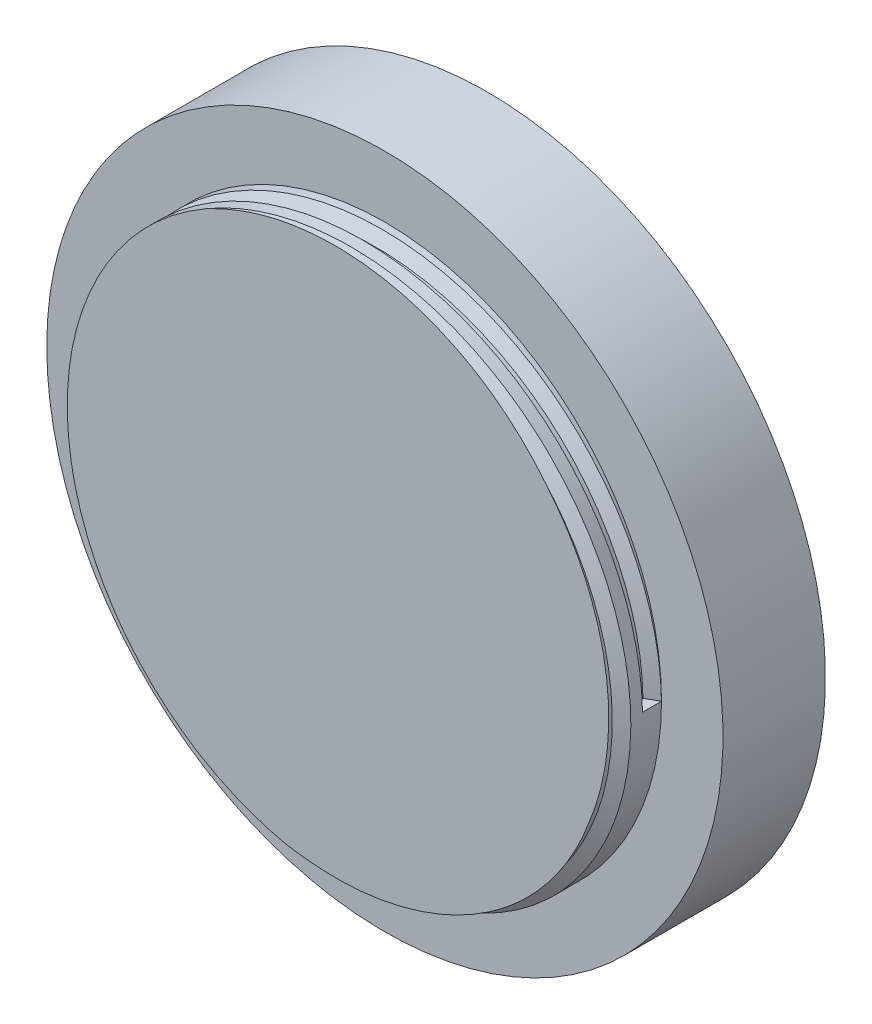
ISO-10303-21;
HEADER;
FILE_DESCRIPTION(('STEP AP214'),'2;1');
FILE_NAME('part.step','',(''),(''),'','','');
FILE_SCHEMA(('AUTOMOTIVE_DESIGN { 1 0 10303 214 1 1 1 1 }'));
ENDSEC;
DATA;
#1=APPLICATION_CONTEXT('core data for automotive mechanical design processes');
#2=APPLICATION_PROTOCOL_DEFINITION('international standard','automotive_design',2000,#1);
#3=PRODUCT_CONTEXT('',#1,'mechanical');
#4=PRODUCT('Part','Part','',(#3));
#5=PRODUCT_RELATED_PRODUCT_CATEGORY('part','',(#4));
#6=PRODUCT_DEFINITION_FORMATION('','',#4);
#7=PRODUCT_DEFINITION_CONTEXT('part definition',#1,'design');
#8=PRODUCT_DEFINITION('design','',#6,#7);
#9=PRODUCT_DEFINITION_SHAPE('','',#8);
#10=(LENGTH_UNIT() NAMED_UNIT(*) SI_UNIT(.MILLI.,.METRE.));
#11=(NAMED_UNIT(*) PLANE_ANGLE_UNIT() SI_UNIT($,.RADIAN.));
#12=(NAMED_UNIT(*) SI_UNIT($,.STERADIAN.) SOLID_ANGLE_UNIT());
#13=UNCERTAINTY_MEASURE_WITH_UNIT(LENGTH_MEASURE(1.E-05),#10,'distance_accuracy_value','');
#14=(GEOMETRIC_REPRESENTATION_CONTEXT(3) GLOBAL_UNCERTAINTY_ASSIGNED_CONTEXT((#13)) GLOBAL_UNIT_ASSIGNED_CONTEXT((#10,
#11,#12)) REPRESENTATION_CONTEXT('',''));
#15=CARTESIAN_POINT('',(0.,0.,0.));
#16=DIRECTION('',(0.,0.,1.));
#17=DIRECTION('',(1.,0.,0.));
#18=AXIS2_PLACEMENT_3D('',#15,#16,#17);
#19=CARTESIAN_POINT('',(0.,0.,2.));
#20=DIRECTION('',(0.,0.,-1.));
#21=DIRECTION('',(-1.,0.,0.));
#22=AXIS2_PLACEMENT_3D('',#19,#20,#21);
#23=CYLINDRICAL_SURFACE('',#22,13.5);
#24=CARTESIAN_POINT('',(13.5,0.,0.));
#25=CARTESIAN_POINT('',(13.5,5.59188309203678,0.09375));
#26=CARTESIAN_POINT('',(9.54594154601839,9.54594154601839,0.1875));
#27=CARTESIAN_POINT('',(5.59188309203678,13.5,0.28125));
#28=CARTESIAN_POINT('',(0.,13.5,0.375));
#29=CARTESIAN_POINT('',(-5.59188309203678,13.5,0.46875));
#30=CARTESIAN_POINT('',(-9.54594154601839,9.54594154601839,0.5625));
#31=CARTESIAN_POINT('',(-13.5,5.59188309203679,0.65625));
#32=CARTESIAN_POINT('',(-13.5,0.,0.75));
#33=CARTESIAN_POINT('',(-13.5,-5.59188309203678,0.84375));
#34=CARTESIAN_POINT('',(-9.54594154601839,-9.54594154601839,0.9375));
#35=CARTESIAN_POINT('',(-5.59188309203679,-13.5,1.03125));
#36=CARTESIAN_POINT('',(0.,-13.5,1.125));
#37=CARTESIAN_POINT('',(5.59188309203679,-13.5,1.21875));
#38=CARTESIAN_POINT('',(9.54594154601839,-9.54594154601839,1.3125));
#39=CARTESIAN_POINT('',(13.5,-5.59188309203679,1.40625));
#40=CARTESIAN_POINT('',(13.5,0.,1.5));
#41=CARTESIAN_POINT('',(13.5,5.59188309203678,1.59375));
#42=CARTESIAN_POINT('',(9.54594154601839,9.54594154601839,1.6875));
#43=CARTESIAN_POINT('',(5.59188309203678,13.5,1.78125));
#44=CARTESIAN_POINT('',(0.,13.5,1.875));
#45=CARTESIAN_POINT('',(-5.59188309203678,13.5,1.96875));
#46=CARTESIAN_POINT('',(-9.54594154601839,9.54594154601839,2.0625));
#47=CARTESIAN_POINT('',(-13.5,5.59188309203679,2.15625));
#48=CARTESIAN_POINT('',(-13.5,0.,2.25));
#49=(BOUNDED_CURVE() B_SPLINE_CURVE(2,(#24,#25,#26,#27,#28,#29,#30,#31,#32,#33,#34,#35,#36,#37,
#38,#39,#40,#41,#42,#43,#44,#45,#46,#47,#48),.UNSPECIFIED.,.F.,
.F.) B_SPLINE_CURVE_WITH_KNOTS((3,2,2,2,2,2,2,2,2,2,2,2,3),(0.,0.0625,0.125,0.1875,0.25,0.3125,
0.375,0.4375,0.5,0.5625,0.625,0.6875,0.75),
.UNSPECIFIED.) CURVE() GEOMETRIC_REPRESENTATION_ITEM() RATIONAL_B_SPLINE_CURVE((1.,
0.923879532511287,1.,0.923879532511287,1.,0.923879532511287,1.,0.923879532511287,1.,
0.923879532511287,1.,0.923879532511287,1.,0.923879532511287,1.,0.923879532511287,1.,
0.923879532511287,1.,0.923879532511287,1.,0.923879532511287,1.,0.923879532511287,1.)) REPRESENTATION_ITEM(''));
#50=CARTESIAN_POINT('',(13.5,0.,0.));
#51=VERTEX_POINT('',#50);
#52=CARTESIAN_POINT('',(-6.71672440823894,11.7105614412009,2.));
#53=VERTEX_POINT('',#52);
#54=EDGE_CURVE('E95',#51,#53,#49,.T.);
#55=ORIENTED_EDGE('',*,*,#54,.F.);
#56=CARTESIAN_POINT('',(0.,0.,0.));
#57=DIRECTION('',(0.,0.,1.));
#58=DIRECTION('',(1.,0.,0.));
#59=AXIS2_PLACEMENT_3D('',#56,#57,#58);
#60=CIRCLE('',#59,13.5);
#61=EDGE_CURVE('E108',#51,#51,#60,.T.);
#62=ORIENTED_EDGE('',*,*,#61,.T.);
#63=DIRECTION('',(0.,0.,1.));
#64=VECTOR('',#63,1.);
#65=CARTESIAN_POINT('',(13.5,0.,0.46302083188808));
#66=LINE('',#65,#64);
#67=CARTESIAN_POINT('',(13.5,0.,0.926041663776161));
#68=VERTEX_POINT('',#67);
#69=EDGE_CURVE('E101',#51,#68,#66,.T.);
#70=ORIENTED_EDGE('',*,*,#69,.T.);
#71=CARTESIAN_POINT('',(13.5,0.,0.926041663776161));
#72=CARTESIAN_POINT('',(13.5,5.59188309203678,1.01979166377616));
#73=CARTESIAN_POINT('',(9.54594154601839,9.54594154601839,1.11354166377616));
#74=CARTESIAN_POINT('',(5.59188309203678,13.5,1.20729166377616));
#75=CARTESIAN_POINT('',(0.,13.5,1.30104166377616));
#76=CARTESIAN_POINT('',(-5.59188309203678,13.5,1.39479166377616));
#77=CARTESIAN_POINT('',(-9.54594154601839,9.54594154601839,1.48854166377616));
#78=CARTESIAN_POINT('',(-13.5,5.59188309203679,1.58229166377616));
#79=CARTESIAN_POINT('',(-13.5,0.,1.67604166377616));
#80=CARTESIAN_POINT('',(-13.5,-5.59188309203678,1.76979166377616));
#81=CARTESIAN_POINT('',(-9.54594154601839,-9.54594154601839,1.86354166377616));
#82=CARTESIAN_POINT('',(-5.59188309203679,-13.5,1.95729166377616));
#83=CARTESIAN_POINT('',(0.,-13.5,2.05104166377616));
#84=CARTESIAN_POINT('',(5.59188309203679,-13.5,2.14479166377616));
#85=CARTESIAN_POINT('',(9.54594154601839,-9.54594154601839,2.23854166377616));
#86=CARTESIAN_POINT('',(13.5,-5.59188309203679,2.33229166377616));
#87=CARTESIAN_POINT('',(13.5,0.,2.42604166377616));
#88=CARTESIAN_POINT('',(13.5,5.59188309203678,2.51979166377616));
#89=CARTESIAN_POINT('',(9.54594154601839,9.54594154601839,2.61354166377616));
#90=CARTESIAN_POINT('',(5.59188309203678,13.5,2.70729166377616));
#91=CARTESIAN_POINT('',(0.,13.5,2.80104166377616));
#92=CARTESIAN_POINT('',(-5.59188309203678,13.5,2.89479166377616));
#93=CARTESIAN_POINT('',(-9.54594154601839,9.54594154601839,2.98854166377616));
#94=CARTESIAN_POINT('',(-13.5,5.59188309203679,3.08229166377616));
#95=CARTESIAN_POINT('',(-13.5,0.,3.17604166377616));
#96=(BOUNDED_CURVE() B_SPLINE_CURVE(2,(#71,#72,#73,#74,#75,#76,#77,#78,#79,#80,#81,#82,#83,#84,
#85,#86,#87,#88,#89,#90,#91,#92,#93,#94,#95),.UNSPECIFIED.,.F.,
.F.) B_SPLINE_CURVE_WITH_KNOTS((3,2,2,2,2,2,2,2,2,2,2,2,3),(0.,0.0625,0.125,0.1875,0.25,0.3125,
0.375,0.4375,0.5,0.5625,0.625,0.6875,0.75),
.UNSPECIFIED.) CURVE() GEOMETRIC_REPRESENTATION_ITEM() RATIONAL_B_SPLINE_CURVE((1.,
0.923879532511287,1.,0.923879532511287,1.,0.923879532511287,1.,0.923879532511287,1.,
0.923879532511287,1.,0.923879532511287,1.,0.923879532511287,1.,0.923879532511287,1.,
0.923879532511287,1.,0.923879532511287,1.,0.923879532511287,1.,0.923879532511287,1.)) REPRESENTATION_ITEM(''));
#97=CARTESIAN_POINT('',(-2.92457966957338,-13.1794136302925,1.99989577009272));
#98=VERTEX_POINT('',#97);
#99=EDGE_CURVE('E85',#68,#98,#96,.T.);
#100=ORIENTED_EDGE('',*,*,#99,.T.);
#101=CARTESIAN_POINT('',(-6.71675455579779,11.7106140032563,2.));
#102=CARTESIAN_POINT('',(-6.89712860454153,11.6071265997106,2.));
#103=CARTESIAN_POINT('',(-7.07507842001,11.4994622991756,2.));
#104=CARTESIAN_POINT('',(-7.33429637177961,11.3343754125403,2.));
#105=CARTESIAN_POINT('',(-7.41754938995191,11.2800595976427,2.));
#106=CARTESIAN_POINT('',(-7.59079307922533,11.1643108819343,2.));
#107=CARTESIAN_POINT('',(-7.6806619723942,11.1026957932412,2.));
#108=CARTESIAN_POINT('',(-7.93973349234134,10.9204313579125,2.));
#109=CARTESIAN_POINT('',(-8.10694652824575,10.796934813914,2.));
#110=CARTESIAN_POINT('',(-8.43528238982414,10.5424621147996,2.));
#111=CARTESIAN_POINT('',(-8.59641157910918,10.4114941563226,2.));
#112=CARTESIAN_POINT('',(-8.91260137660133,10.14208701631,2.));
#113=CARTESIAN_POINT('',(-9.06765531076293,10.0036399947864,2.));
#114=CARTESIAN_POINT('',(-9.3300250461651,9.75827576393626,2.));
#115=CARTESIAN_POINT('',(-9.43887733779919,9.65299751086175,2.));
#116=CARTESIAN_POINT('',(-9.58620783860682,9.5056783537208,2.));
#117=CARTESIAN_POINT('',(-9.62622121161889,9.4651637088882,2.));
#118=CARTESIAN_POINT('',(-9.81115000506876,9.27554311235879,2.));
#119=CARTESIAN_POINT('',(-9.95291343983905,9.12333136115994,2.));
#120=CARTESIAN_POINT('',(-10.229001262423,8.812759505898,2.));
#121=CARTESIAN_POINT('',(-10.3633372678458,8.65440970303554,2.));
#122=CARTESIAN_POINT('',(-10.6245954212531,8.3315632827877,2.));
#123=CARTESIAN_POINT('',(-10.7515135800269,8.16706343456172,2.));
#124=CARTESIAN_POINT('',(-10.9950569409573,7.83587448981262,2.));
#125=CARTESIAN_POINT('',(-11.1118415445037,7.66930249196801,2.));
#126=CARTESIAN_POINT('',(-11.3431644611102,7.32312261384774,2.));
#127=CARTESIAN_POINT('',(-11.4573373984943,7.14327036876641,2.));
#128=CARTESIAN_POINT('',(-11.6742776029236,6.78291560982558,2.));
#129=CARTESIAN_POINT('',(-11.7772587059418,6.60254184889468,2.));
#130=CARTESIAN_POINT('',(-11.9747433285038,6.23721897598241,2.));
#131=CARTESIAN_POINT('',(-12.0692468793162,6.05226988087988,2.));
#132=CARTESIAN_POINT('',(-12.2703129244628,5.6352445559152,2.));
#133=CARTESIAN_POINT('',(-12.3746639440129,5.40209574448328,2.));
#134=CARTESIAN_POINT('',(-12.5340061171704,5.0174468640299,2.));
#135=CARTESIAN_POINT('',(-12.5929961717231,4.86758494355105,2.));
#136=CARTESIAN_POINT('',(-12.7218931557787,4.52210382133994,2.));
#137=CARTESIAN_POINT('',(-12.7900089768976,4.3258112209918,2.));
#138=CARTESIAN_POINT('',(-12.9170266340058,3.93039255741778,2.));
#139=CARTESIAN_POINT('',(-12.9759334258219,3.73126808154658,2.));
#140=CARTESIAN_POINT('',(-13.0845559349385,3.33017475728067,2.));
#141=CARTESIAN_POINT('',(-13.1342567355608,3.12820185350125,2.));
#142=CARTESIAN_POINT('',(-13.2007891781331,2.82827202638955,2.));
#143=CARTESIAN_POINT('',(-13.2212272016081,2.73110170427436,2.));
#144=CARTESIAN_POINT('',(-13.2618818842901,2.52675403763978,2.));
#145=CARTESIAN_POINT('',(-13.28187884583,2.41953290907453,2.));
#146=CARTESIAN_POINT('',(-13.3362007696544,2.10735430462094,2.));
#147=CARTESIAN_POINT('',(-13.3671079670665,1.90179127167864,2.));
#148=CARTESIAN_POINT('',(-13.4193271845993,1.48968251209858,2.));
#149=CARTESIAN_POINT('',(-13.4406494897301,1.28313808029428,2.));
#150=CARTESIAN_POINT('',(-13.4737199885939,0.869057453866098,2.));
#151=CARTESIAN_POINT('',(-13.4854579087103,0.661520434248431,2.));
#152=CARTESIAN_POINT('',(-13.4974705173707,0.302604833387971,2.));
#153=CARTESIAN_POINT('',(-13.4999941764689,0.151298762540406,2.));
#154=CARTESIAN_POINT('',(-13.5000021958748,-0.0570501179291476,2.));
#155=CARTESIAN_POINT('',(-13.4996464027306,-0.114099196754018,2.));
#156=CARTESIAN_POINT('',(-13.4963211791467,-0.379052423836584,2.));
#157=CARTESIAN_POINT('',(-13.4889281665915,-0.58692380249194,2.));
#158=CARTESIAN_POINT('',(-13.4645344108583,-1.00175390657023,2.));
#159=CARTESIAN_POINT('',(-13.4475491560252,-1.20871356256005,2.));
#160=CARTESIAN_POINT('',(-13.403989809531,-1.62173695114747,2.));
#161=CARTESIAN_POINT('',(-13.3774106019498,-1.8278001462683,2.));
#162=CARTESIAN_POINT('',(-13.3154422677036,-2.23409016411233,2.));
#163=CARTESIAN_POINT('',(-13.2802534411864,-2.43434763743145,2.));
#164=CARTESIAN_POINT('',(-13.1990373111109,-2.84270371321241,2.));
#165=CARTESIAN_POINT('',(-13.1525692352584,-3.05071484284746,2.));
#166=CARTESIAN_POINT('',(-13.0511243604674,-3.45902529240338,2.));
#167=CARTESIAN_POINT('',(-12.9963947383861,-3.659386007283,2.));
#168=CARTESIAN_POINT('',(-12.8777056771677,-4.05734817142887,2.));
#169=CARTESIAN_POINT('',(-12.8137462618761,-4.2549496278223,2.));
#170=CARTESIAN_POINT('',(-12.6610648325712,-4.69190174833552,2.));
#171=CARTESIAN_POINT('',(-12.5700264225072,-4.9304490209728,2.));
#172=CARTESIAN_POINT('',(-12.4107104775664,-5.31510887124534,2.));
#173=CARTESIAN_POINT('',(-12.3464099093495,-5.46288692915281,2.));
#174=CARTESIAN_POINT('',(-12.1932094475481,-5.79841645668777,2.));
#175=CARTESIAN_POINT('',(-12.1025703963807,-5.98537911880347,2.));
#176=CARTESIAN_POINT('',(-11.912773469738,-6.35479274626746,2.));
#177=CARTESIAN_POINT('',(-11.8136202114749,-6.53724608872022,2.));
#178=CARTESIAN_POINT('',(-11.6068033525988,-6.89766498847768,2.));
#179=CARTESIAN_POINT('',(-11.4991263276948,-7.0756228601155,2.));
#180=CARTESIAN_POINT('',(-11.3341407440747,-7.33465673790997,2.));
#181=CARTESIAN_POINT('',(-11.279940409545,-7.41772798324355,2.));
#182=CARTESIAN_POINT('',(-11.1641920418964,-7.59097072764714,2.));
#183=CARTESIAN_POINT('',(-11.1024536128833,-7.68101511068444,2.));
#184=CARTESIAN_POINT('',(-10.9200537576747,-7.94025319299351,2.));
#185=CARTESIAN_POINT('',(-10.7965495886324,-8.10745976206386,2.));
#186=CARTESIAN_POINT('',(-10.5420615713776,-8.43578296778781,2.));
#187=CARTESIAN_POINT('',(-10.411085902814,-8.59690595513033,2.));
#188=CARTESIAN_POINT('',(-10.1416633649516,-8.91308330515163,2.));
#189=CARTESIAN_POINT('',(-10.0032086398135,-9.06813097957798,2.));
#190=CARTESIAN_POINT('',(-9.75797795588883,-9.33033295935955,2.));
#191=CARTESIAN_POINT('',(-9.65284610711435,-9.43902875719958,2.));
#192=CARTESIAN_POINT('',(-9.50552679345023,-9.5863594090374,2.));
#193=CARTESIAN_POINT('',(-9.46485868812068,-9.62652244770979,2.));
#194=CARTESIAN_POINT('',(-9.27507625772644,-9.81159152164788,2.));
#195=CARTESIAN_POINT('',(-9.12285818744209,-9.95334731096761,2.));
#196=CARTESIAN_POINT('',(-8.81227370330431,-10.2294198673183,2.));
#197=CARTESIAN_POINT('',(-8.65391757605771,-10.3637482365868,2.));
#198=CARTESIAN_POINT('',(-8.33105849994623,-10.6249911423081,2.));
#199=CARTESIAN_POINT('',(-8.16655230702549,-10.7519016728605,2.));
#200=CARTESIAN_POINT('',(-7.83552394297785,-10.9953027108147,2.));
#201=CARTESIAN_POINT('',(-7.6691245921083,-11.1119604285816,2.));
#202=CARTESIAN_POINT('',(-7.3229448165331,-11.3432832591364,2.));
#203=CARTESIAN_POINT('',(-7.14290911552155,-11.4575666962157,2.));
#204=CARTESIAN_POINT('',(-6.78236098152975,-11.6745999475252,2.));
#205=CARTESIAN_POINT('',(-6.6019825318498,-11.7775723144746,2.));
#206=CARTESIAN_POINT('',(-6.23665022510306,-11.9750394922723,2.));
#207=CARTESIAN_POINT('',(-6.05169637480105,-12.0695343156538,2.));
#208=CARTESIAN_POINT('',(-5.63485397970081,-12.2704877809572,2.));
#209=CARTESIAN_POINT('',(-5.40189831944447,-12.3747458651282,2.));
#210=CARTESIAN_POINT('',(-5.0172491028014,-12.5340879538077,2.));
#211=CARTESIAN_POINT('',(-4.86718643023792,-12.5931527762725,2.));
#212=CARTESIAN_POINT('',(-4.52149938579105,-12.7221084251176,2.));
#213=CARTESIAN_POINT('',(-4.32520461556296,-12.7902154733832,2.));
#214=CARTESIAN_POINT('',(-3.92977818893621,-12.9172123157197,2.));
#215=CARTESIAN_POINT('',(-3.73064811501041,-12.9761070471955,2.));
#216=CARTESIAN_POINT('',(-3.32955623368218,-13.0847176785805,2.));
#217=CARTESIAN_POINT('',(-3.12759038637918,-13.1344186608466,2.));
#218=CARTESIAN_POINT('',(-2.92458219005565,-13.1794249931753,2.));
#219=B_SPLINE_CURVE_WITH_KNOTS('',3,(#101,#102,#103,#104,#105,#106,#107,#108,#109,#110,#111,
#112,#113,#114,#115,#116,#117,#118,#119,#120,#121,#122,#123,#124,#125,#126,#127,#128,#129,#130,
#131,#132,#133,#134,#135,#136,#137,#138,#139,#140,#141,#142,#143,#144,#145,#146,#147,#148,#149,
#150,#151,#152,#153,#154,#155,#156,#157,#158,#159,#160,#161,#162,#163,#164,#165,#166,#167,#168,
#169,#170,#171,#172,#173,#174,#175,#176,#177,#178,#179,#180,#181,#182,#183,#184,#185,#186,#187,
#188,#189,#190,#191,#192,#193,#194,#195,#196,#197,#198,#199,#200,#201,#202,#203,#204,#205,#206,
#207,#208,#209,#210,#211,#212,#213,#214,#215,#216,#217,#218),.UNSPECIFIED.,.F.,.F.,(4,2,2,2,2,2,
2,2,2,2,2,2,2,2,2,2,2,2,2,2,2,2,2,2,2,2,2,2,2,2,2,2,2,2,2,2,2,2,2,2,2,2,2,2,2,2,2,2,2,2,2,2,2,2,
2,2,2,2,4),(0.,0.623750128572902,0.921941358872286,1.24880187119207,1.87218239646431,
2.49489171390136,3.11826696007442,3.57248071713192,3.74330815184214,4.3670648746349,
4.98981661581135,5.61290023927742,6.22299662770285,6.8618515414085,7.48472921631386,
8.10760459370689,8.87345923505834,9.35653777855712,9.97962484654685,10.6023754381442,
11.2261264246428,11.5239961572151,11.8511778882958,12.4745577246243,13.0972670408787,
13.7206429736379,14.1745355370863,14.3456844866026,14.9694403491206,15.5921919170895,
16.2152760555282,16.8250515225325,17.4642271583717,18.0871044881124,18.7099802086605,
19.4755141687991,19.9589136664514,20.5820002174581,21.2047509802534,21.8285028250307,
22.1260510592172,22.4535540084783,23.0769331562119,23.6996424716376,24.3230190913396,
24.7765904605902,24.9480609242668,25.5718159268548,26.1945673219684,26.8176519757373,
27.4271065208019,28.0666028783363,28.6894798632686,29.3123559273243,30.0775692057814,
30.5612896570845,31.184375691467,31.8071266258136,32.4308793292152),.UNSPECIFIED.);
#220=EDGE_CURVE('E144',#53,#98,#219,.T.);
#221=ORIENTED_EDGE('',*,*,#220,.F.);
#222=EDGE_LOOP('',(#55,#62,#70,#100,#221));
#223=FACE_BOUND('',#222,.T.);
#224=ADVANCED_FACE('F41',(#223),#23,.T.);
#225=CARTESIAN_POINT('',(0.,0.,2.));
#226=DIRECTION('',(0.,0.,1.));
#227=DIRECTION('',(1.,0.,0.));
#228=AXIS2_PLACEMENT_3D('',#225,#226,#227);
#229=PLANE('',#228);
#230=CARTESIAN_POINT('',(11.9113435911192,-5.02308339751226,2.));
#231=CARTESIAN_POINT('',(11.9798991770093,-4.86053241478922,2.));
#232=CARTESIAN_POINT('',(12.0451274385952,-4.69655101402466,2.));
#233=CARTESIAN_POINT('',(12.2307548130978,-4.20055500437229,2.));
#234=CARTESIAN_POINT('',(12.3410014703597,-3.86469053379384,2.));
#235=CARTESIAN_POINT('',(12.5339414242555,-3.18393413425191,2.));
#236=CARTESIAN_POINT('',(12.6165394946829,-2.83901533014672,2.));
#237=CARTESIAN_POINT('',(12.7531244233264,-2.14355875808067,2.));
#238=CARTESIAN_POINT('',(12.807112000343,-1.7930211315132,2.));
#239=CARTESIAN_POINT('',(12.8859752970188,-1.08988683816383,2.));
#240=CARTESIAN_POINT('',(12.9109485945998,-0.73730110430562,2.));
#241=CARTESIAN_POINT('',(12.9319458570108,-0.0312678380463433,2.));
#242=CARTESIAN_POINT('',(12.9279698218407,0.322179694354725,2.));
#243=CARTESIAN_POINT('',(12.8910945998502,1.02756259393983,2.));
#244=CARTESIAN_POINT('',(12.8581954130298,1.37949796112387,2.));
#245=CARTESIAN_POINT('',(12.7636950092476,2.07949366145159,2.));
#246=CARTESIAN_POINT('',(12.7020937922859,2.42755399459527,2.));
#247=CARTESIAN_POINT('',(12.5503450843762,3.1186360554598,2.));
#248=CARTESIAN_POINT('',(12.4601013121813,3.46163664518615,2.));
#249=CARTESIAN_POINT('',(12.2517425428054,4.13906497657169,2.));
#250=CARTESIAN_POINT('',(12.1336275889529,4.47349273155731,2.));
#251=CARTESIAN_POINT('',(11.8707707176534,5.13039998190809,2.));
#252=CARTESIAN_POINT('',(11.7261202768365,5.45291608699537,2.));
#253=CARTESIAN_POINT('',(11.4109015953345,6.08502613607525,2.));
#254=CARTESIAN_POINT('',(11.2403333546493,6.39462008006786,2.));
#255=CARTESIAN_POINT('',(10.877682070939,6.99340916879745,2.));
#256=CARTESIAN_POINT('',(10.6860367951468,7.28286957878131,2.));
#257=CARTESIAN_POINT('',(10.2787846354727,7.84730432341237,2.));
#258=CARTESIAN_POINT('',(10.063029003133,8.12217133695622,2.));
#259=CARTESIAN_POINT('',(9.83645563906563,8.38782530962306,2.));
#260=B_SPLINE_CURVE_WITH_KNOTS('',3,(#230,#231,#232,#233,#234,#235,#236,#237,#238,#239,#240,
#241,#242,#243,#244,#245,#246,#247,#248,#249,#250,#251,#252,#253,#254,#255,#256,#257,#258,#259),
.UNSPECIFIED.,.F.,.F.,(4,2,2,2,2,2,2,2,2,2,2,2,2,2,4),(0.,0.52927758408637,1.58850021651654,
2.65133432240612,3.71414172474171,4.77336435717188,5.83258698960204,6.8918096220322,
7.95103225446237,9.01385383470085,10.0766737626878,11.135896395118,12.1951190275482,
13.2354582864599,14.2826128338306),.UNSPECIFIED.);
#261=CARTESIAN_POINT('',(11.9113435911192,-5.02308339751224,2.));
#262=VERTEX_POINT('',#261);
#263=CARTESIAN_POINT('',(9.83645563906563,8.38782530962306,2.));
#264=VERTEX_POINT('',#263);
#265=EDGE_CURVE('E50',#262,#264,#260,.T.);
#266=ORIENTED_EDGE('',*,*,#265,.T.);
#267=CARTESIAN_POINT('',(9.83645563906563,8.38782530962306,2.));
#268=CARTESIAN_POINT('',(9.76320439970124,8.47936435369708,2.));
#269=CARTESIAN_POINT('',(9.6886981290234,8.56989555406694,2.));
#270=CARTESIAN_POINT('',(9.53724213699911,8.74885573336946,2.));
#271=CARTESIAN_POINT('',(9.46029296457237,8.83728517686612,2.));
#272=CARTESIAN_POINT('',(9.2254745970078,9.09975020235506,2.));
#273=CARTESIAN_POINT('',(9.06396903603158,9.27054439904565,2.));
#274=CARTESIAN_POINT('',(8.63764996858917,9.6978219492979,2.));
#275=CARTESIAN_POINT('',(8.36629823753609,9.9478269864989,2.));
#276=CARTESIAN_POINT('',(7.80335389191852,10.424195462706,2.));
#277=CARTESIAN_POINT('',(7.51175003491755,10.6505455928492,2.));
#278=CARTESIAN_POINT('',(6.91050163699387,11.0778786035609,2.));
#279=CARTESIAN_POINT('',(6.60085697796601,11.2788613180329,2.));
#280=CARTESIAN_POINT('',(5.96588521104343,11.6539253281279,2.));
#281=CARTESIAN_POINT('',(5.64056571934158,11.8280195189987,2.));
#282=CARTESIAN_POINT('',(4.98094569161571,12.1460048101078,2.));
#283=CARTESIAN_POINT('',(4.64682799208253,12.2902752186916,2.));
#284=CARTESIAN_POINT('',(3.96809973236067,12.5504309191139,2.));
#285=CARTESIAN_POINT('',(3.62349956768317,12.6663433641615,2.));
#286=CARTESIAN_POINT('',(2.92568950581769,12.8692099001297,2.));
#287=CARTESIAN_POINT('',(2.57247644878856,12.9561531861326,2.));
#288=CARTESIAN_POINT('',(2.0382353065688,13.0643419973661,2.));
#289=CARTESIAN_POINT('',(1.85938914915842,13.0967039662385,2.));
#290=CARTESIAN_POINT('',(1.50045427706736,13.1539768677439,2.));
#291=CARTESIAN_POINT('',(1.32036529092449,13.1788861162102,2.));
#292=CARTESIAN_POINT('',(0.959374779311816,13.2211945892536,2.));
#293=CARTESIAN_POINT('',(0.778473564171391,13.2385964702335,2.));
#294=CARTESIAN_POINT('',(0.416087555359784,13.2658546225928,2.));
#295=CARTESIAN_POINT('',(0.234602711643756,13.2757102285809,2.));
#296=CARTESIAN_POINT('',(-0.128622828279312,13.2879350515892,2.));
#297=CARTESIAN_POINT('',(-0.310363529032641,13.2903041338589,2.));
#298=CARTESIAN_POINT('',(-0.673776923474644,13.2877030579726,2.));
#299=CARTESIAN_POINT('',(-0.855449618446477,13.2827330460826,2.));
#300=CARTESIAN_POINT('',(-1.3998311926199,13.2567704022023,2.));
#301=CARTESIAN_POINT('',(-1.76207668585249,13.224730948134,2.));
#302=CARTESIAN_POINT('',(-2.48281885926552,13.1314072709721,2.));
#303=CARTESIAN_POINT('',(-2.84131478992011,13.0701173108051,2.00000000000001));
#304=CARTESIAN_POINT('',(-3.5025434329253,12.9292641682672,2.00000000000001));
#305=CARTESIAN_POINT('',(-3.80607797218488,12.8534433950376,2.));
#306=CARTESIAN_POINT('',(-4.40720017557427,12.6807967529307,2.));
#307=CARTESIAN_POINT('',(-4.70478638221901,12.5839658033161,2.));
#308=CARTESIAN_POINT('',(-5.29318402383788,12.3695183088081,2.));
#309=CARTESIAN_POINT('',(-5.58397740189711,12.2518522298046,2.));
#310=CARTESIAN_POINT('',(-6.1565734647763,11.9965166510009,2.));
#311=CARTESIAN_POINT('',(-6.43837797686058,11.8588512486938,2.));
#312=CARTESIAN_POINT('',(-6.71501218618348,11.7114734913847,2.));
#313=B_SPLINE_CURVE_WITH_KNOTS('',3,(#267,#268,#269,#270,#271,#272,#273,#274,#275,#276,#277,
#278,#279,#280,#281,#282,#283,#284,#285,#286,#287,#288,#289,#290,#291,#292,#293,#294,#295,#296,
#297,#298,#299,#300,#301,#302,#303,#304,#305,#306,#307,#308,#309,#310,#311,#312),.UNSPECIFIED.,
.F.,.F.,(4,2,2,2,2,2,2,2,2,2,2,2,2,2,2,2,2,2,2,2,2,2,4),(0.,0.35170236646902,0.703326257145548,
1.40817793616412,2.51369388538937,3.6198285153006,4.72597038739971,5.83158011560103,
6.92212112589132,8.01161380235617,9.10151238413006,9.6466354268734,10.1918815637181,
10.7369346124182,11.2820357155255,11.8271466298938,12.3722466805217,13.461928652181,
14.5518244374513,15.4896619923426,16.4277265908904,17.3680520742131,18.3081851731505),.UNSPECIFIED.);
#314=EDGE_CURVE('E12',#264,#53,#313,.T.);
#315=ORIENTED_EDGE('',*,*,#314,.T.);
#316=ORIENTED_EDGE('',*,*,#220,.T.);
#317=CARTESIAN_POINT('',(-13.5,0.,3.17604166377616));
#318=CARTESIAN_POINT('',(-13.5,5.59188309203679,3.08229166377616));
#319=CARTESIAN_POINT('',(-9.54594154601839,9.54594154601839,2.98854166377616));
#320=CARTESIAN_POINT('',(-5.59188309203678,13.5,2.89479166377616));
#321=CARTESIAN_POINT('',(0.,13.5,2.80104166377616));
#322=CARTESIAN_POINT('',(5.59188309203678,13.5,2.70729166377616));
#323=CARTESIAN_POINT('',(9.54594154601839,9.54594154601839,2.61354166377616));
#324=CARTESIAN_POINT('',(13.5,5.59188309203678,2.51979166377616));
#325=CARTESIAN_POINT('',(13.5,0.,2.42604166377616));
#326=CARTESIAN_POINT('',(13.5,-5.59188309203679,2.33229166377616));
#327=CARTESIAN_POINT('',(9.54594154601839,-9.54594154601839,2.23854166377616));
#328=CARTESIAN_POINT('',(5.59188309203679,-13.5,2.14479166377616));
#329=CARTESIAN_POINT('',(0.,-13.5,2.05104166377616));
#330=CARTESIAN_POINT('',(-5.59188309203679,-13.5,1.95729166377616));
#331=CARTESIAN_POINT('',(-9.54594154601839,-9.54594154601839,1.86354166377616));
#332=CARTESIAN_POINT('',(-13.5,-5.59188309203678,1.76979166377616));
#333=CARTESIAN_POINT('',(-13.5,0.,1.67604166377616));
#334=CARTESIAN_POINT('',(-13.5,5.59188309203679,1.58229166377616));
#335=CARTESIAN_POINT('',(-9.54594154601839,9.54594154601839,1.48854166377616));
#336=CARTESIAN_POINT('',(-5.59188309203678,13.5,1.39479166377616));
#337=CARTESIAN_POINT('',(0.,13.5,1.30104166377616));
#338=CARTESIAN_POINT('',(5.59188309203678,13.5,1.20729166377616));
#339=CARTESIAN_POINT('',(9.54594154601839,9.54594154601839,1.11354166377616));
#340=CARTESIAN_POINT('',(13.5,5.59188309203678,1.01979166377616));
#341=CARTESIAN_POINT('',(13.5,0.,0.926041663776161));
#342=(BOUNDED_CURVE() B_SPLINE_CURVE(2,(#317,#318,#319,#320,#321,#322,#323,#324,#325,#326,#327,
#328,#329,#330,#331,#332,#333,#334,#335,#336,#337,#338,#339,#340,#341),.UNSPECIFIED.,.F.,
.F.) B_SPLINE_CURVE_WITH_KNOTS((3,2,2,2,2,2,2,2,2,2,2,2,3),(0.,0.0625,0.125,0.1875,0.25,0.3125,
0.375,0.4375,0.5,0.5625,0.625,0.6875,0.75),
.UNSPECIFIED.) CURVE() GEOMETRIC_REPRESENTATION_ITEM() RATIONAL_B_SPLINE_CURVE((1.,
0.923879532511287,1.,0.923879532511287,1.,0.923879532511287,1.,0.923879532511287,1.,
0.923879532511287,1.,0.923879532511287,1.,0.923879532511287,1.,0.923879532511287,1.,
0.923879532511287,1.,0.923879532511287,1.,0.923879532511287,1.,0.923879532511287,1.)) REPRESENTATION_ITEM(''));
#343=CARTESIAN_POINT('',(-2.91298680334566,-13.1819839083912,2.));
#344=VERTEX_POINT('',#343);
#345=EDGE_CURVE('E90',#98,#344,#342,.F.);
#346=ORIENTED_EDGE('',*,*,#345,.T.);
#347=CARTESIAN_POINT('',(-2.91276062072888,-13.1820266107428,2.));
#348=CARTESIAN_POINT('',(-2.68211939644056,-13.2255516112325,2.));
#349=CARTESIAN_POINT('',(-2.45038352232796,-13.2630874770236,2.));
#350=CARTESIAN_POINT('',(-1.98532685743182,-13.3260871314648,2.));
#351=CARTESIAN_POINT('',(-1.75200641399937,-13.3515534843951,2.));
#352=CARTESIAN_POINT('',(-1.14786887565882,-13.4016512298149,2.));
#353=CARTESIAN_POINT('',(-0.77623874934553,-13.4171300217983,2.));
#354=CARTESIAN_POINT('',(-0.218685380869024,-13.4175110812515,2.));
#355=CARTESIAN_POINT('',(-0.0326888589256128,-13.413821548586,2.));
#356=CARTESIAN_POINT('',(0.339015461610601,-13.398637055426,2.));
#357=CARTESIAN_POINT('',(0.524723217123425,-13.387141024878,2.));
#358=CARTESIAN_POINT('',(1.08112454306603,-13.3408990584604,2.));
#359=CARTESIAN_POINT('',(1.45090863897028,-13.2943990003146,2.));
#360=CARTESIAN_POINT('',(2.18526964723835,-13.1704115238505,2.));
#361=CARTESIAN_POINT('',(2.54984553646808,-13.0929181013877,2.));
#362=CARTESIAN_POINT('',(3.27119778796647,-12.9074816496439,2.));
#363=CARTESIAN_POINT('',(3.62797384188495,-12.7995374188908,2.));
#364=CARTESIAN_POINT('',(4.33099480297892,-12.5540256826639,2.));
#365=CARTESIAN_POINT('',(4.677244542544,-12.4164720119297,2.));
#366=CARTESIAN_POINT('',(5.35228995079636,-12.1147630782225,2.));
#367=CARTESIAN_POINT('',(5.68125922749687,-11.950996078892,2.));
#368=CARTESIAN_POINT('',(6.32416065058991,-11.5968576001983,2.));
#369=CARTESIAN_POINT('',(6.63810639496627,-11.4065108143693,2.));
#370=CARTESIAN_POINT('',(7.24921813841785,-11.0003488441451,2.));
#371=CARTESIAN_POINT('',(7.54637789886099,-10.7845242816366,2.));
#372=CARTESIAN_POINT('',(8.1218382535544,-10.3288740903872,2.));
#373=CARTESIAN_POINT('',(8.40013544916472,-10.0890441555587,2.));
#374=CARTESIAN_POINT('',(8.7997851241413,-9.71458805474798,2.));
#375=CARTESIAN_POINT('',(8.92909534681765,-9.58835666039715,2.));
#376=CARTESIAN_POINT('',(9.18245327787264,-9.33072942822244,2.));
#377=CARTESIAN_POINT('',(9.30650121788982,-9.19933381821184,2.));
#378=CARTESIAN_POINT('',(9.67021898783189,-8.79748001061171,2.));
#379=CARTESIAN_POINT('',(9.90149582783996,-8.51932395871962,2.));
#380=CARTESIAN_POINT('',(10.3067627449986,-7.98809229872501,2.));
#381=CARTESIAN_POINT('',(10.484129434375,-7.7375734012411,2.));
#382=CARTESIAN_POINT('',(10.8206412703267,-7.2244584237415,2.));
#383=CARTESIAN_POINT('',(10.9797813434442,-6.96185900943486,2.));
#384=CARTESIAN_POINT('',(11.2793931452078,-6.42520845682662,2.));
#385=CARTESIAN_POINT('',(11.4198085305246,-6.15112587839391,2.));
#386=CARTESIAN_POINT('',(11.6806936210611,-5.59370700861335,2.));
#387=CARTESIAN_POINT('',(11.8011680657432,-5.31037293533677,2.));
#388=CARTESIAN_POINT('',(11.9113435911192,-5.02308339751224,2.));
#389=B_SPLINE_CURVE_WITH_KNOTS('',3,(#347,#348,#349,#350,#351,#352,#353,#354,#355,#356,#357,
#358,#359,#360,#361,#362,#363,#364,#365,#366,#367,#368,#369,#370,#371,#372,#373,#374,#375,#376,
#377,#378,#379,#380,#381,#382,#383,#384,#385,#386,#387,#388),.UNSPECIFIED.,.F.,.F.,(4,2,2,2,2,2,
2,2,2,2,2,2,2,2,2,2,2,2,2,2,4),(0.,0.703987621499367,1.40782560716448,2.52223359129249,
3.08020207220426,3.63824705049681,4.75489779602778,5.87176496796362,6.98867621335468,
8.1050667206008,9.20623605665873,10.3063890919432,11.4069483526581,12.5077053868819,
13.049700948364,13.5916726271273,14.6754806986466,15.5956039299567,16.5159826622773,
17.4390711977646,18.3619400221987),.UNSPECIFIED.);
#390=EDGE_CURVE('E178',#344,#262,#389,.T.);
#391=ORIENTED_EDGE('',*,*,#390,.T.);
#392=EDGE_LOOP('',(#266,#315,#316,#346,#391));
#393=FACE_BOUND('',#392,.T.);
#394=ADVANCED_FACE('F150',(#393),#229,.T.);
#395=CARTESIAN_POINT('',(0.,0.,-5.));
#396=DIRECTION('',(0.,0.,1.));
#397=DIRECTION('',(1.,0.,0.));
#398=AXIS2_PLACEMENT_3D('',#395,#396,#397);
#399=CYLINDRICAL_SURFACE('',#398,16.5);
#400=CARTESIAN_POINT('',(0.,0.,-5.));
#401=DIRECTION('',(0.,0.,-1.));
#402=DIRECTION('',(-1.,0.,0.));
#403=AXIS2_PLACEMENT_3D('',#400,#401,#402);
#404=CIRCLE('',#403,16.5);
#405=CARTESIAN_POINT('',(-16.5,0.,-5.));
#406=VERTEX_POINT('',#405);
#407=EDGE_CURVE('E120',#406,#406,#404,.T.);
#408=ORIENTED_EDGE('',*,*,#407,.F.);
#409=EDGE_LOOP('',(#408));
#410=FACE_BOUND('',#409,.T.);
#411=CARTESIAN_POINT('',(0.,0.,0.));
#412=DIRECTION('',(0.,0.,-1.));
#413=DIRECTION('',(-1.,0.,0.));
#414=AXIS2_PLACEMENT_3D('',#411,#412,#413);
#415=CIRCLE('',#414,16.5);
#416=CARTESIAN_POINT('',(-16.5,0.,0.));
#417=VERTEX_POINT('',#416);
#418=EDGE_CURVE('E117',#417,#417,#415,.T.);
#419=ORIENTED_EDGE('',*,*,#418,.T.);
#420=EDGE_LOOP('',(#419));
#421=FACE_BOUND('',#420,.T.);
#422=ADVANCED_FACE('F159',(#410,#421),#399,.T.);
#423=CARTESIAN_POINT('',(0.,0.,-5.));
#424=DIRECTION('',(0.,0.,-1.));
#425=DIRECTION('',(-1.,0.,0.));
#426=AXIS2_PLACEMENT_3D('',#423,#424,#425);
#427=PLANE('',#426);
#428=ORIENTED_EDGE('',*,*,#407,.T.);
#429=EDGE_LOOP('',(#428));
#430=FACE_BOUND('',#429,.T.);
#431=ADVANCED_FACE('F214',(#430),#427,.T.);
#432=CARTESIAN_POINT('',(0.,0.,0.));
#433=DIRECTION('',(0.,0.,-1.));
#434=DIRECTION('',(-1.,0.,0.));
#435=AXIS2_PLACEMENT_3D('',#432,#433,#434);
#436=PLANE('',#435);
#437=ORIENTED_EDGE('',*,*,#61,.F.);
#438=EDGE_LOOP('',(#437));
#439=FACE_BOUND('',#438,.T.);
#440=ORIENTED_EDGE('',*,*,#418,.F.);
#441=EDGE_LOOP('',(#440));
#442=FACE_BOUND('',#441,.T.);
#443=ADVANCED_FACE('F213',(#439,#442),#436,.F.);
#444=CARTESIAN_POINT('',(13.2135801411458,0.,0.165364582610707));
#445=DIRECTION('',(0.,-1.,0.));
#446=DIRECTION('',(0.,0.,-1.));
#447=AXIS2_PLACEMENT_3D('',#444,#445,#446);
#448=PLANE('',#447);
#449=DIRECTION('',(0.86602540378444,0.,-0.499999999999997));
#450=VECTOR('',#449,1.);
#451=CARTESIAN_POINT('',(13.2135801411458,0.,0.165364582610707));
#452=LINE('',#451,#450);
#453=CARTESIAN_POINT('',(12.9271602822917,0.,0.330729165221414));
#454=VERTEX_POINT('',#453);
#455=EDGE_CURVE('E116',#454,#51,#452,.T.);
#456=ORIENTED_EDGE('',*,*,#455,.F.);
#457=DIRECTION('',(0.,0.,-1.));
#458=VECTOR('',#457,1.);
#459=CARTESIAN_POINT('',(12.9271602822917,0.,0.46302083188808));
#460=LINE('',#459,#458);
#461=CARTESIAN_POINT('',(12.9271602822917,0.,0.595312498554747));
#462=VERTEX_POINT('',#461);
#463=EDGE_CURVE('E103',#462,#454,#460,.T.);
#464=ORIENTED_EDGE('',*,*,#463,.F.);
#465=DIRECTION('',(-0.86602540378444,0.,-0.499999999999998));
#466=VECTOR('',#465,1.);
#467=CARTESIAN_POINT('',(13.2135801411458,0.,0.760677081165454));
#468=LINE('',#467,#466);
#469=EDGE_CURVE('E88',#68,#462,#468,.T.);
#470=ORIENTED_EDGE('',*,*,#469,.F.);
#471=ORIENTED_EDGE('',*,*,#69,.F.);
#472=EDGE_LOOP('',(#456,#464,#470,#471));
#473=FACE_BOUND('',#472,.T.);
#474=ADVANCED_FACE('F100',(#473),#448,.F.);
#475=CARTESIAN_POINT('',(12.9271602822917,0.,0.330729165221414));
#476=CARTESIAN_POINT('',(12.9271602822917,5.35460511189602,0.424479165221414));
#477=CARTESIAN_POINT('',(9.14088269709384,9.14088269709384,0.518229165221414));
#478=CARTESIAN_POINT('',(5.35460511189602,12.9271602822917,0.611979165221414));
#479=CARTESIAN_POINT('',(0.,12.9271602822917,0.705729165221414));
#480=CARTESIAN_POINT('',(-5.35460511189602,12.9271602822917,0.799479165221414));
#481=CARTESIAN_POINT('',(-9.14088269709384,9.14088269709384,0.893229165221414));
#482=CARTESIAN_POINT('',(-12.9271602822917,5.35460511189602,0.986979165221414));
#483=CARTESIAN_POINT('',(-12.9271602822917,0.,1.08072916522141));
#484=CARTESIAN_POINT('',(-12.9271602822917,-5.35460511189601,1.17447916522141));
#485=CARTESIAN_POINT('',(-9.14088269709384,-9.14088269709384,1.26822916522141));
#486=CARTESIAN_POINT('',(-5.35460511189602,-12.9271602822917,1.36197916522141));
#487=CARTESIAN_POINT('',(0.,-12.9271602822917,1.45572916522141));
#488=CARTESIAN_POINT('',(5.35460511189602,-12.9271602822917,1.54947916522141));
#489=CARTESIAN_POINT('',(9.14088269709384,-9.14088269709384,1.64322916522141));
#490=CARTESIAN_POINT('',(12.9271602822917,-5.35460511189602,1.73697916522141));
#491=CARTESIAN_POINT('',(12.9271602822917,0.,1.83072916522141));
#492=CARTESIAN_POINT('',(12.9271602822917,5.35460511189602,1.92447916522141));
#493=CARTESIAN_POINT('',(9.14088269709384,9.14088269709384,2.01822916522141));
#494=CARTESIAN_POINT('',(5.35460511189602,12.9271602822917,2.11197916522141));
#495=CARTESIAN_POINT('',(0.,12.9271602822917,2.20572916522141));
#496=CARTESIAN_POINT('',(-5.35460511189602,12.9271602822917,2.29947916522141));
#497=CARTESIAN_POINT('',(-9.14088269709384,9.14088269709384,2.39322916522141));
#498=CARTESIAN_POINT('',(-12.9271602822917,5.35460511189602,2.48697916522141));
#499=CARTESIAN_POINT('',(-12.9271602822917,0.,2.58072916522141));
#500=CARTESIAN_POINT('',(13.5,0.,0.));
#501=CARTESIAN_POINT('',(13.5,5.59188309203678,0.09375));
#502=CARTESIAN_POINT('',(9.54594154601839,9.54594154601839,0.1875));
#503=CARTESIAN_POINT('',(5.59188309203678,13.5,0.28125));
#504=CARTESIAN_POINT('',(0.,13.5,0.375));
#505=CARTESIAN_POINT('',(-5.59188309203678,13.5,0.46875));
#506=CARTESIAN_POINT('',(-9.54594154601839,9.54594154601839,0.5625));
#507=CARTESIAN_POINT('',(-13.5,5.59188309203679,0.65625));
#508=CARTESIAN_POINT('',(-13.5,0.,0.75));
#509=CARTESIAN_POINT('',(-13.5,-5.59188309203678,0.84375));
#510=CARTESIAN_POINT('',(-9.54594154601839,-9.54594154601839,0.9375));
#511=CARTESIAN_POINT('',(-5.59188309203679,-13.5,1.03125));
#512=CARTESIAN_POINT('',(0.,-13.5,1.125));
#513=CARTESIAN_POINT('',(5.59188309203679,-13.5,1.21875));
#514=CARTESIAN_POINT('',(9.54594154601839,-9.54594154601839,1.3125));
#515=CARTESIAN_POINT('',(13.5,-5.59188309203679,1.40625));
#516=CARTESIAN_POINT('',(13.5,0.,1.5));
#517=CARTESIAN_POINT('',(13.5,5.59188309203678,1.59375));
#518=CARTESIAN_POINT('',(9.54594154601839,9.54594154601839,1.6875));
#519=CARTESIAN_POINT('',(5.59188309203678,13.5,1.78125));
#520=CARTESIAN_POINT('',(0.,13.5,1.875));
#521=CARTESIAN_POINT('',(-5.59188309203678,13.5,1.96875));
#522=CARTESIAN_POINT('',(-9.54594154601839,9.54594154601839,2.0625));
#523=CARTESIAN_POINT('',(-13.5,5.59188309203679,2.15625));
#524=CARTESIAN_POINT('',(-13.5,0.,2.25));
#525=(BOUNDED_SURFACE() B_SPLINE_SURFACE(1,2,((#475,#476,#477,#478,#479,#480,#481,#482,#483,
#484,#485,#486,#487,#488,#489,#490,#491,#492,#493,#494,#495,#496,#497,#498,#499),(#500,#501,
#502,#503,#504,#505,#506,#507,#508,#509,#510,#511,#512,#513,#514,#515,#516,#517,#518,#519,#520,
#521,#522,#523,#524)),.UNSPECIFIED.,.F.,.F.,.F.) B_SPLINE_SURFACE_WITH_KNOTS((2,2),(3,2,2,2,2,2,
2,2,2,2,2,2,3),(0.,1.),(0.,0.0625,0.125,0.1875,0.25,0.3125,0.375,0.4375,0.5,0.5625,0.625,0.6875,
0.75),.UNSPECIFIED.) GEOMETRIC_REPRESENTATION_ITEM() RATIONAL_B_SPLINE_SURFACE(((1.,
0.923879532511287,1.,0.923879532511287,1.,0.923879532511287,1.,0.923879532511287,1.,
0.923879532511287,1.,0.923879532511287,1.,0.923879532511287,1.,0.923879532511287,1.,
0.923879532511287,1.,0.923879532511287,1.,0.923879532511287,1.,0.923879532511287,1.),(1.,
0.923879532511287,1.,0.923879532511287,1.,0.923879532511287,1.,0.923879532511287,1.,
0.923879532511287,1.,0.923879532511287,1.,0.923879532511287,1.,0.923879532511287,1.,
0.923879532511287,1.,0.923879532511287,1.,0.923879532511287,1.,0.923879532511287,1.))) REPRESENTATION_ITEM('') SURFACE());
#526=CARTESIAN_POINT('',(12.9271602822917,0.,0.330729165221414));
#527=CARTESIAN_POINT('',(12.9271602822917,5.35460511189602,0.424479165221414));
#528=CARTESIAN_POINT('',(9.14088269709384,9.14088269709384,0.518229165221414));
#529=CARTESIAN_POINT('',(5.35460511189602,12.9271602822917,0.611979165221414));
#530=CARTESIAN_POINT('',(0.,12.9271602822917,0.705729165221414));
#531=CARTESIAN_POINT('',(-5.35460511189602,12.9271602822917,0.799479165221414));
#532=CARTESIAN_POINT('',(-9.14088269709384,9.14088269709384,0.893229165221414));
#533=CARTESIAN_POINT('',(-12.9271602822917,5.35460511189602,0.986979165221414));
#534=CARTESIAN_POINT('',(-12.9271602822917,0.,1.08072916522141));
#535=CARTESIAN_POINT('',(-12.9271602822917,-5.35460511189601,1.17447916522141));
#536=CARTESIAN_POINT('',(-9.14088269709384,-9.14088269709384,1.26822916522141));
#537=CARTESIAN_POINT('',(-5.35460511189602,-12.9271602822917,1.36197916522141));
#538=CARTESIAN_POINT('',(0.,-12.9271602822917,1.45572916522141));
#539=CARTESIAN_POINT('',(5.35460511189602,-12.9271602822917,1.54947916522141));
#540=CARTESIAN_POINT('',(9.14088269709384,-9.14088269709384,1.64322916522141));
#541=CARTESIAN_POINT('',(12.9271602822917,-5.35460511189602,1.73697916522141));
#542=CARTESIAN_POINT('',(12.9271602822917,0.,1.83072916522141));
#543=CARTESIAN_POINT('',(12.9271602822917,5.35460511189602,1.92447916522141));
#544=CARTESIAN_POINT('',(9.14088269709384,9.14088269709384,2.01822916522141));
#545=CARTESIAN_POINT('',(5.35460511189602,12.9271602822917,2.11197916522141));
#546=CARTESIAN_POINT('',(0.,12.9271602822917,2.20572916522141));
#547=CARTESIAN_POINT('',(-5.35460511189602,12.9271602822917,2.29947916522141));
#548=CARTESIAN_POINT('',(-9.14088269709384,9.14088269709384,2.39322916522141));
#549=CARTESIAN_POINT('',(-12.9271602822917,5.35460511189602,2.48697916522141));
#550=CARTESIAN_POINT('',(-12.9271602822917,0.,2.58072916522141));
#551=(BOUNDED_CURVE() B_SPLINE_CURVE(2,(#526,#527,#528,#529,#530,#531,#532,#533,#534,#535,#536,
#537,#538,#539,#540,#541,#542,#543,#544,#545,#546,#547,#548,#549,#550),.UNSPECIFIED.,.F.,
.F.) B_SPLINE_CURVE_WITH_KNOTS((3,2,2,2,2,2,2,2,2,2,2,2,3),(0.,0.0625,0.125,0.1875,0.25,0.3125,
0.375,0.4375,0.5,0.5625,0.625,0.6875,0.75),
.UNSPECIFIED.) CURVE() GEOMETRIC_REPRESENTATION_ITEM() RATIONAL_B_SPLINE_CURVE((1.,
0.923879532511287,1.,0.923879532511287,1.,0.923879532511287,1.,0.923879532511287,1.,
0.923879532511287,1.,0.923879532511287,1.,0.923879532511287,1.,0.923879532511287,1.,
0.923879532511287,1.,0.923879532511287,1.,0.923879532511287,1.,0.923879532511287,1.)) REPRESENTATION_ITEM(''));
#552=EDGE_CURVE('E118',#454,#264,#551,.T.);
#553=ORIENTED_EDGE('',*,*,#552,.F.);
#554=ORIENTED_EDGE('',*,*,#455,.T.);
#555=ORIENTED_EDGE('',*,*,#54,.T.);
#556=ORIENTED_EDGE('',*,*,#314,.F.);
#557=EDGE_LOOP('',(#553,#554,#555,#556));
#558=FACE_BOUND('',#557,.T.);
#559=ADVANCED_FACE('F185',(#558),#525,.T.);
#560=CARTESIAN_POINT('',(12.9271602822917,0.,0.595312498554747));
#561=CARTESIAN_POINT('',(12.9271602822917,5.35460511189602,0.689062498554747));
#562=CARTESIAN_POINT('',(9.14088269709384,9.14088269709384,0.782812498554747));
#563=CARTESIAN_POINT('',(5.35460511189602,12.9271602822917,0.876562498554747));
#564=CARTESIAN_POINT('',(0.,12.9271602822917,0.970312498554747));
#565=CARTESIAN_POINT('',(-5.35460511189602,12.9271602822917,1.06406249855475));
#566=CARTESIAN_POINT('',(-9.14088269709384,9.14088269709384,1.15781249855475));
#567=CARTESIAN_POINT('',(-12.9271602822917,5.35460511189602,1.25156249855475));
#568=CARTESIAN_POINT('',(-12.9271602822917,0.,1.34531249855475));
#569=CARTESIAN_POINT('',(-12.9271602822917,-5.35460511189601,1.43906249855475));
#570=CARTESIAN_POINT('',(-9.14088269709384,-9.14088269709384,1.53281249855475));
#571=CARTESIAN_POINT('',(-5.35460511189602,-12.9271602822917,1.62656249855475));
#572=CARTESIAN_POINT('',(0.,-12.9271602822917,1.72031249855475));
#573=CARTESIAN_POINT('',(5.35460511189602,-12.9271602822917,1.81406249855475));
#574=CARTESIAN_POINT('',(9.14088269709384,-9.14088269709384,1.90781249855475));
#575=CARTESIAN_POINT('',(12.9271602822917,-5.35460511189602,2.00156249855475));
#576=CARTESIAN_POINT('',(12.9271602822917,0.,2.09531249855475));
#577=CARTESIAN_POINT('',(12.9271602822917,5.35460511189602,2.18906249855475));
#578=CARTESIAN_POINT('',(9.14088269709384,9.14088269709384,2.28281249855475));
#579=CARTESIAN_POINT('',(5.35460511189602,12.9271602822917,2.37656249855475));
#580=CARTESIAN_POINT('',(0.,12.9271602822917,2.47031249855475));
#581=CARTESIAN_POINT('',(-5.35460511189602,12.9271602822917,2.56406249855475));
#582=CARTESIAN_POINT('',(-9.14088269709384,9.14088269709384,2.65781249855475));
#583=CARTESIAN_POINT('',(-12.9271602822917,5.35460511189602,2.75156249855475));
#584=CARTESIAN_POINT('',(-12.9271602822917,0.,2.84531249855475));
#585=CARTESIAN_POINT('',(12.9271602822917,0.,0.330729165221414));
#586=CARTESIAN_POINT('',(12.9271602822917,5.35460511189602,0.424479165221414));
#587=CARTESIAN_POINT('',(9.14088269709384,9.14088269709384,0.518229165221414));
#588=CARTESIAN_POINT('',(5.35460511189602,12.9271602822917,0.611979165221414));
#589=CARTESIAN_POINT('',(0.,12.9271602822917,0.705729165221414));
#590=CARTESIAN_POINT('',(-5.35460511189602,12.9271602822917,0.799479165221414));
#591=CARTESIAN_POINT('',(-9.14088269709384,9.14088269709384,0.893229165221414));
#592=CARTESIAN_POINT('',(-12.9271602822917,5.35460511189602,0.986979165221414));
#593=CARTESIAN_POINT('',(-12.9271602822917,0.,1.08072916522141));
#594=CARTESIAN_POINT('',(-12.9271602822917,-5.35460511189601,1.17447916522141));
#595=CARTESIAN_POINT('',(-9.14088269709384,-9.14088269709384,1.26822916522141));
#596=CARTESIAN_POINT('',(-5.35460511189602,-12.9271602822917,1.36197916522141));
#597=CARTESIAN_POINT('',(0.,-12.9271602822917,1.45572916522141));
#598=CARTESIAN_POINT('',(5.35460511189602,-12.9271602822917,1.54947916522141));
#599=CARTESIAN_POINT('',(9.14088269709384,-9.14088269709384,1.64322916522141));
#600=CARTESIAN_POINT('',(12.9271602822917,-5.35460511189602,1.73697916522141));
#601=CARTESIAN_POINT('',(12.9271602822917,0.,1.83072916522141));
#602=CARTESIAN_POINT('',(12.9271602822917,5.35460511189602,1.92447916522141));
#603=CARTESIAN_POINT('',(9.14088269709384,9.14088269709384,2.01822916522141));
#604=CARTESIAN_POINT('',(5.35460511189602,12.9271602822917,2.11197916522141));
#605=CARTESIAN_POINT('',(0.,12.9271602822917,2.20572916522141));
#606=CARTESIAN_POINT('',(-5.35460511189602,12.9271602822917,2.29947916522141));
#607=CARTESIAN_POINT('',(-9.14088269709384,9.14088269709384,2.39322916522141));
#608=CARTESIAN_POINT('',(-12.9271602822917,5.35460511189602,2.48697916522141));
#609=CARTESIAN_POINT('',(-12.9271602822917,0.,2.58072916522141));
#610=(BOUNDED_SURFACE() B_SPLINE_SURFACE(1,2,((#560,#561,#562,#563,#564,#565,#566,#567,#568,
#569,#570,#571,#572,#573,#574,#575,#576,#577,#578,#579,#580,#581,#582,#583,#584),(#585,#586,
#587,#588,#589,#590,#591,#592,#593,#594,#595,#596,#597,#598,#599,#600,#601,#602,#603,#604,#605,
#606,#607,#608,#609)),.UNSPECIFIED.,.F.,.F.,.F.) B_SPLINE_SURFACE_WITH_KNOTS((2,2),(3,2,2,2,2,2,
2,2,2,2,2,2,3),(0.,1.),(0.,0.0625,0.125,0.1875,0.25,0.3125,0.375,0.4375,0.5,0.5625,0.625,0.6875,
0.75),.UNSPECIFIED.) GEOMETRIC_REPRESENTATION_ITEM() RATIONAL_B_SPLINE_SURFACE(((1.,
0.923879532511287,1.,0.923879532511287,1.,0.923879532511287,1.,0.923879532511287,1.,
0.923879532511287,1.,0.923879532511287,1.,0.923879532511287,1.,0.923879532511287,1.,
0.923879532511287,1.,0.923879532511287,1.,0.923879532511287,1.,0.923879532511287,1.),(1.,
0.923879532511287,1.,0.923879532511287,1.,0.923879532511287,1.,0.923879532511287,1.,
0.923879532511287,1.,0.923879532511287,1.,0.923879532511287,1.,0.923879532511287,1.,
0.923879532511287,1.,0.923879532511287,1.,0.923879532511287,1.,0.923879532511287,1.))) REPRESENTATION_ITEM('') SURFACE());
#611=CARTESIAN_POINT('',(12.9271602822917,0.,0.595312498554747));
#612=CARTESIAN_POINT('',(12.9271602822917,5.35460511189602,0.689062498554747));
#613=CARTESIAN_POINT('',(9.14088269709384,9.14088269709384,0.782812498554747));
#614=CARTESIAN_POINT('',(5.35460511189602,12.9271602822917,0.876562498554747));
#615=CARTESIAN_POINT('',(0.,12.9271602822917,0.970312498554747));
#616=CARTESIAN_POINT('',(-5.35460511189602,12.9271602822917,1.06406249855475));
#617=CARTESIAN_POINT('',(-9.14088269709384,9.14088269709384,1.15781249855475));
#618=CARTESIAN_POINT('',(-12.9271602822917,5.35460511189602,1.25156249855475));
#619=CARTESIAN_POINT('',(-12.9271602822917,0.,1.34531249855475));
#620=CARTESIAN_POINT('',(-12.9271602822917,-5.35460511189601,1.43906249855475));
#621=CARTESIAN_POINT('',(-9.14088269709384,-9.14088269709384,1.53281249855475));
#622=CARTESIAN_POINT('',(-5.35460511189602,-12.9271602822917,1.62656249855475));
#623=CARTESIAN_POINT('',(0.,-12.9271602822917,1.72031249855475));
#624=CARTESIAN_POINT('',(5.35460511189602,-12.9271602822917,1.81406249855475));
#625=CARTESIAN_POINT('',(9.14088269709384,-9.14088269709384,1.90781249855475));
#626=CARTESIAN_POINT('',(12.9271602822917,-5.35460511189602,2.00156249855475));
#627=CARTESIAN_POINT('',(12.9271602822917,0.,2.09531249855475));
#628=CARTESIAN_POINT('',(12.9271602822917,5.35460511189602,2.18906249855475));
#629=CARTESIAN_POINT('',(9.14088269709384,9.14088269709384,2.28281249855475));
#630=CARTESIAN_POINT('',(5.35460511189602,12.9271602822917,2.37656249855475));
#631=CARTESIAN_POINT('',(0.,12.9271602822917,2.47031249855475));
#632=CARTESIAN_POINT('',(-5.35460511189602,12.9271602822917,2.56406249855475));
#633=CARTESIAN_POINT('',(-9.14088269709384,9.14088269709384,2.65781249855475));
#634=CARTESIAN_POINT('',(-12.9271602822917,5.35460511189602,2.75156249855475));
#635=CARTESIAN_POINT('',(-12.9271602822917,0.,2.84531249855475));
#636=(BOUNDED_CURVE() B_SPLINE_CURVE(2,(#611,#612,#613,#614,#615,#616,#617,#618,#619,#620,#621,
#622,#623,#624,#625,#626,#627,#628,#629,#630,#631,#632,#633,#634,#635),.UNSPECIFIED.,.F.,
.F.) B_SPLINE_CURVE_WITH_KNOTS((3,2,2,2,2,2,2,2,2,2,2,2,3),(0.,0.0625,0.125,0.1875,0.25,0.3125,
0.375,0.4375,0.5,0.5625,0.625,0.6875,0.75),
.UNSPECIFIED.) CURVE() GEOMETRIC_REPRESENTATION_ITEM() RATIONAL_B_SPLINE_CURVE((1.,
0.923879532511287,1.,0.923879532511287,1.,0.923879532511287,1.,0.923879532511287,1.,
0.923879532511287,1.,0.923879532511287,1.,0.923879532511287,1.,0.923879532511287,1.,
0.923879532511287,1.,0.923879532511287,1.,0.923879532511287,1.,0.923879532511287,1.)) REPRESENTATION_ITEM(''));
#637=EDGE_CURVE('E58',#462,#262,#636,.T.);
#638=ORIENTED_EDGE('',*,*,#637,.F.);
#639=ORIENTED_EDGE('',*,*,#463,.T.);
#640=ORIENTED_EDGE('',*,*,#552,.T.);
#641=ORIENTED_EDGE('',*,*,#265,.F.);
#642=EDGE_LOOP('',(#638,#639,#640,#641));
#643=FACE_BOUND('',#642,.T.);
#644=ADVANCED_FACE('F179',(#643),#610,.T.);
#645=CARTESIAN_POINT('',(13.5,0.,0.926041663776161));
#646=CARTESIAN_POINT('',(13.5,5.59188309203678,1.01979166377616));
#647=CARTESIAN_POINT('',(9.54594154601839,9.54594154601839,1.11354166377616));
#648=CARTESIAN_POINT('',(5.59188309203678,13.5,1.20729166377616));
#649=CARTESIAN_POINT('',(0.,13.5,1.30104166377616));
#650=CARTESIAN_POINT('',(-5.59188309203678,13.5,1.39479166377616));
#651=CARTESIAN_POINT('',(-9.54594154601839,9.54594154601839,1.48854166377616));
#652=CARTESIAN_POINT('',(-13.5,5.59188309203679,1.58229166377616));
#653=CARTESIAN_POINT('',(-13.5,0.,1.67604166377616));
#654=CARTESIAN_POINT('',(-13.5,-5.59188309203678,1.76979166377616));
#655=CARTESIAN_POINT('',(-9.54594154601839,-9.54594154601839,1.86354166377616));
#656=CARTESIAN_POINT('',(-5.59188309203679,-13.5,1.95729166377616));
#657=CARTESIAN_POINT('',(0.,-13.5,2.05104166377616));
#658=CARTESIAN_POINT('',(5.59188309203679,-13.5,2.14479166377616));
#659=CARTESIAN_POINT('',(9.54594154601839,-9.54594154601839,2.23854166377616));
#660=CARTESIAN_POINT('',(13.5,-5.59188309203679,2.33229166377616));
#661=CARTESIAN_POINT('',(13.5,0.,2.42604166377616));
#662=CARTESIAN_POINT('',(13.5,5.59188309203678,2.51979166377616));
#663=CARTESIAN_POINT('',(9.54594154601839,9.54594154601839,2.61354166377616));
#664=CARTESIAN_POINT('',(5.59188309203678,13.5,2.70729166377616));
#665=CARTESIAN_POINT('',(0.,13.5,2.80104166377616));
#666=CARTESIAN_POINT('',(-5.59188309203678,13.5,2.89479166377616));
#667=CARTESIAN_POINT('',(-9.54594154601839,9.54594154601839,2.98854166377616));
#668=CARTESIAN_POINT('',(-13.5,5.59188309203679,3.08229166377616));
#669=CARTESIAN_POINT('',(-13.5,0.,3.17604166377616));
#670=CARTESIAN_POINT('',(12.9271602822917,0.,0.595312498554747));
#671=CARTESIAN_POINT('',(12.9271602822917,5.35460511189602,0.689062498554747));
#672=CARTESIAN_POINT('',(9.14088269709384,9.14088269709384,0.782812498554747));
#673=CARTESIAN_POINT('',(5.35460511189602,12.9271602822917,0.876562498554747));
#674=CARTESIAN_POINT('',(0.,12.9271602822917,0.970312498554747));
#675=CARTESIAN_POINT('',(-5.35460511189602,12.9271602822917,1.06406249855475));
#676=CARTESIAN_POINT('',(-9.14088269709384,9.14088269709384,1.15781249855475));
#677=CARTESIAN_POINT('',(-12.9271602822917,5.35460511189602,1.25156249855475));
#678=CARTESIAN_POINT('',(-12.9271602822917,0.,1.34531249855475));
#679=CARTESIAN_POINT('',(-12.9271602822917,-5.35460511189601,1.43906249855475));
#680=CARTESIAN_POINT('',(-9.14088269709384,-9.14088269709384,1.53281249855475));
#681=CARTESIAN_POINT('',(-5.35460511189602,-12.9271602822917,1.62656249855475));
#682=CARTESIAN_POINT('',(0.,-12.9271602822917,1.72031249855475));
#683=CARTESIAN_POINT('',(5.35460511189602,-12.9271602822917,1.81406249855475));
#684=CARTESIAN_POINT('',(9.14088269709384,-9.14088269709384,1.90781249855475));
#685=CARTESIAN_POINT('',(12.9271602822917,-5.35460511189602,2.00156249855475));
#686=CARTESIAN_POINT('',(12.9271602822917,0.,2.09531249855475));
#687=CARTESIAN_POINT('',(12.9271602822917,5.35460511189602,2.18906249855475));
#688=CARTESIAN_POINT('',(9.14088269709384,9.14088269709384,2.28281249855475));
#689=CARTESIAN_POINT('',(5.35460511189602,12.9271602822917,2.37656249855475));
#690=CARTESIAN_POINT('',(0.,12.9271602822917,2.47031249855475));
#691=CARTESIAN_POINT('',(-5.35460511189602,12.9271602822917,2.56406249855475));
#692=CARTESIAN_POINT('',(-9.14088269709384,9.14088269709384,2.65781249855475));
#693=CARTESIAN_POINT('',(-12.9271602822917,5.35460511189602,2.75156249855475));
#694=CARTESIAN_POINT('',(-12.9271602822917,0.,2.84531249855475));
#695=(BOUNDED_SURFACE() B_SPLINE_SURFACE(1,2,((#645,#646,#647,#648,#649,#650,#651,#652,#653,
#654,#655,#656,#657,#658,#659,#660,#661,#662,#663,#664,#665,#666,#667,#668,#669),(#670,#671,
#672,#673,#674,#675,#676,#677,#678,#679,#680,#681,#682,#683,#684,#685,#686,#687,#688,#689,#690,
#691,#692,#693,#694)),.UNSPECIFIED.,.F.,.F.,.F.) B_SPLINE_SURFACE_WITH_KNOTS((2,2),(3,2,2,2,2,2,
2,2,2,2,2,2,3),(0.,1.),(0.,0.0625,0.125,0.1875,0.25,0.3125,0.375,0.4375,0.5,0.5625,0.625,0.6875,
0.75),.UNSPECIFIED.) GEOMETRIC_REPRESENTATION_ITEM() RATIONAL_B_SPLINE_SURFACE(((1.,
0.923879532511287,1.,0.923879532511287,1.,0.923879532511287,1.,0.923879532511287,1.,
0.923879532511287,1.,0.923879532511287,1.,0.923879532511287,1.,0.923879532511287,1.,
0.923879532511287,1.,0.923879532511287,1.,0.923879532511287,1.,0.923879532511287,1.),(1.,
0.923879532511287,1.,0.923879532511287,1.,0.923879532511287,1.,0.923879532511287,1.,
0.923879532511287,1.,0.923879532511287,1.,0.923879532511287,1.,0.923879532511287,1.,
0.923879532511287,1.,0.923879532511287,1.,0.923879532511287,1.,0.923879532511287,1.))) REPRESENTATION_ITEM('') SURFACE());
#696=ORIENTED_EDGE('',*,*,#345,.F.);
#697=ORIENTED_EDGE('',*,*,#99,.F.);
#698=ORIENTED_EDGE('',*,*,#469,.T.);
#699=ORIENTED_EDGE('',*,*,#637,.T.);
#700=ORIENTED_EDGE('',*,*,#390,.F.);
#701=EDGE_LOOP('',(#696,#697,#698,#699,#700));
#702=FACE_BOUND('',#701,.T.);
#703=ADVANCED_FACE('F87',(#702),#695,.T.);
#704=CLOSED_SHELL('',(#224,#394,#422,#431,#443,#474,#559,#644,#703));
#705=MANIFOLD_SOLID_BREP('B2',#704);
#706=ADVANCED_BREP_SHAPE_REPRESENTATION('',(#18,#705),#14);
#707=SHAPE_DEFINITION_REPRESENTATION(#9,#706);
ENDSEC;
END-ISO-10303-21;
